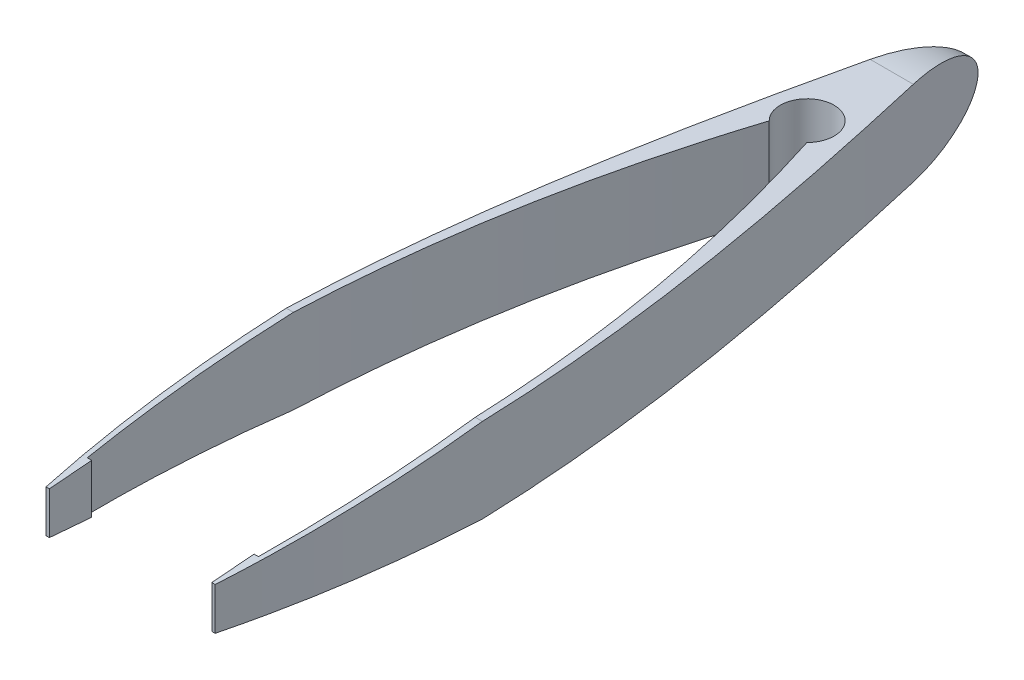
ISO-10303-21;
HEADER;
FILE_DESCRIPTION(('STEP AP214'),'2;1');
FILE_NAME('part.step','',(''),(''),'','','');
FILE_SCHEMA(('AUTOMOTIVE_DESIGN { 1 0 10303 214 1 1 1 1 }'));
ENDSEC;
DATA;
#1=APPLICATION_CONTEXT('core data for automotive mechanical design processes');
#2=APPLICATION_PROTOCOL_DEFINITION('international standard','automotive_design',2000,#1);
#3=PRODUCT_CONTEXT('',#1,'mechanical');
#4=PRODUCT('Part','Part','',(#3));
#5=PRODUCT_RELATED_PRODUCT_CATEGORY('part','',(#4));
#6=PRODUCT_DEFINITION_FORMATION('','',#4);
#7=PRODUCT_DEFINITION_CONTEXT('part definition',#1,'design');
#8=PRODUCT_DEFINITION('design','',#6,#7);
#9=PRODUCT_DEFINITION_SHAPE('','',#8);
#10=(LENGTH_UNIT() NAMED_UNIT(*) SI_UNIT(.MILLI.,.METRE.));
#11=(NAMED_UNIT(*) PLANE_ANGLE_UNIT() SI_UNIT($,.RADIAN.));
#12=(NAMED_UNIT(*) SI_UNIT($,.STERADIAN.) SOLID_ANGLE_UNIT());
#13=UNCERTAINTY_MEASURE_WITH_UNIT(LENGTH_MEASURE(1.E-05),#10,'distance_accuracy_value','');
#14=(GEOMETRIC_REPRESENTATION_CONTEXT(3) GLOBAL_UNCERTAINTY_ASSIGNED_CONTEXT((#13)) GLOBAL_UNIT_ASSIGNED_CONTEXT((#10,
#11,#12)) REPRESENTATION_CONTEXT('',''));
#15=CARTESIAN_POINT('',(0.,0.,0.));
#16=DIRECTION('',(0.,0.,1.));
#17=DIRECTION('',(1.,0.,0.));
#18=AXIS2_PLACEMENT_3D('',#15,#16,#17);
#19=CARTESIAN_POINT('',(-0.2,5.,-100.));
#20=CARTESIAN_POINT('',(-8.02463248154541,5.,-67.3414548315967));
#21=CARTESIAN_POINT('',(-15.036037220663,5.,-33.9340234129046));
#22=CARTESIAN_POINT('',(-10.,5.,0.));
#23=B_SPLINE_CURVE_WITH_KNOTS('',3,(#19,#20,#21,#22),.UNSPECIFIED.,.F.,.F.,(4,4),(0.,1.),.UNSPECIFIED.);
#24=DIRECTION('',(0.,-1.,0.));
#25=VECTOR('',#24,1.);
#26=SURFACE_OF_LINEAR_EXTRUSION('',#23,#25);
#27=CARTESIAN_POINT('',(-2.55320496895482,4.99999999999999,-90.));
#28=CARTESIAN_POINT('',(-2.51110031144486,4.99999542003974,-90.1831487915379));
#29=CARTESIAN_POINT('',(-2.46893483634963,4.99748473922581,-90.3662738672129));
#30=CARTESIAN_POINT('',(-2.38451092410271,4.98741612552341,-90.7323702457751));
#31=CARTESIAN_POINT('',(-2.34225248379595,4.97985801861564,-90.9153415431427));
#32=CARTESIAN_POINT('',(-2.21535430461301,4.94955288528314,-91.4639793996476));
#33=CARTESIAN_POINT('',(-2.130622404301,4.91917499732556,-91.829236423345));
#34=CARTESIAN_POINT('',(-1.96122988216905,4.83732250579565,-92.5574509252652));
#35=CARTESIAN_POINT('',(-1.87656927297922,4.78584473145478,-92.9204080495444));
#36=CARTESIAN_POINT('',(-1.70769191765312,4.66041025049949,-93.6425994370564));
#37=CARTESIAN_POINT('',(-1.62347518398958,4.58645291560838,-94.0018335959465));
#38=CARTESIAN_POINT('',(-1.47207357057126,4.43044575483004,-94.6461699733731));
#39=CARTESIAN_POINT('',(-1.40472174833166,4.35267273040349,-94.9322685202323));
#40=CARTESIAN_POINT('',(-1.27104755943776,4.17941520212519,-95.4991216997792));
#41=CARTESIAN_POINT('',(-1.20472442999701,4.0839445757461,-95.7798803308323));
#42=CARTESIAN_POINT('',(-1.09053801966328,3.9002465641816,-96.2625005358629));
#43=CARTESIAN_POINT('',(-1.04233440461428,3.81652550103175,-96.4659974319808));
#44=CARTESIAN_POINT('',(-0.946963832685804,3.63665573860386,-96.8681826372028));
#45=CARTESIAN_POINT('',(-0.899798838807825,3.54048553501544,-97.0668619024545));
#46=CARTESIAN_POINT('',(-0.816977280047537,3.35639570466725,-97.4153980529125));
#47=CARTESIAN_POINT('',(-0.781022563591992,3.27113240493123,-97.5665846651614));
#48=CARTESIAN_POINT('',(-0.710341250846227,3.09106093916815,-97.8635800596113));
#49=CARTESIAN_POINT('',(-0.675615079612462,2.99624951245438,-98.0093869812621));
#50=CARTESIAN_POINT('',(-0.607870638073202,2.7962288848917,-98.2936426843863));
#51=CARTESIAN_POINT('',(-0.574848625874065,2.69104408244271,-98.4321076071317));
#52=CARTESIAN_POINT('',(-0.510990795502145,2.46891547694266,-98.6997127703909));
#53=CARTESIAN_POINT('',(-0.480153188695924,2.35198148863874,-98.8288606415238));
#54=CARTESIAN_POINT('',(-0.420633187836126,2.101789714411,-99.0780023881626));
#55=CARTESIAN_POINT('',(-0.392027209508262,1.96818783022,-99.1976729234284));
#56=CARTESIAN_POINT('',(-0.33901284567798,1.68578875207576,-99.4193574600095));
#57=CARTESIAN_POINT('',(-0.314606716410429,1.53698345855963,-99.5213619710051));
#58=CARTESIAN_POINT('',(-0.282214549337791,1.30147973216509,-99.6567001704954));
#59=CARTESIAN_POINT('',(-0.27205879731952,1.22025761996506,-99.6991235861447));
#60=CARTESIAN_POINT('',(-0.253490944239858,1.05423359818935,-99.7766757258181));
#61=CARTESIAN_POINT('',(-0.245077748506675,0.969433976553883,-99.8118090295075));
#62=CARTESIAN_POINT('',(-0.230254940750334,0.796964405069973,-99.8737020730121));
#63=CARTESIAN_POINT('',(-0.223838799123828,0.709304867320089,-99.9004891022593));
#64=CARTESIAN_POINT('',(-0.213194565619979,0.53161577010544,-99.9449250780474));
#65=CARTESIAN_POINT('',(-0.208964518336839,0.441588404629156,-99.9625821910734));
#66=CARTESIAN_POINT('',(-0.203948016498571,0.292782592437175,-99.9835214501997));
#67=CARTESIAN_POINT('',(-0.20247010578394,0.234420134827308,-99.9896901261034));
#68=CARTESIAN_POINT('',(-0.200495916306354,0.117373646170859,-99.9979301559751));
#69=CARTESIAN_POINT('',(-0.199999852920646,0.0586895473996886,-100.000000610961));
#70=CARTESIAN_POINT('',(-0.200000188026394,-0.0750287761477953,-99.9999992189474));
#71=CARTESIAN_POINT('',(-0.20081133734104,-0.150066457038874,-99.9966136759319));
#72=CARTESIAN_POINT('',(-0.204034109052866,-0.299533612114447,-99.9831620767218));
#73=CARTESIAN_POINT('',(-0.206446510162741,-0.373962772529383,-99.9730927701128));
#74=CARTESIAN_POINT('',(-0.212812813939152,-0.521734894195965,-99.9465182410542));
#75=CARTESIAN_POINT('',(-0.216769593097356,-0.595075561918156,-99.9300010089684));
#76=CARTESIAN_POINT('',(-0.226125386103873,-0.740045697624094,-99.8909425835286));
#77=CARTESIAN_POINT('',(-0.231524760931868,-0.811674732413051,-99.8683998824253));
#78=CARTESIAN_POINT('',(-0.244940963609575,-0.967919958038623,-99.8123802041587));
#79=CARTESIAN_POINT('',(-0.253270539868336,-1.05204175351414,-99.7775961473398));
#80=CARTESIAN_POINT('',(-0.271641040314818,-1.21673614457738,-99.7008685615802));
#81=CARTESIAN_POINT('',(-0.2816824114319,-1.29730780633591,-99.6589231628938));
#82=CARTESIAN_POINT('',(-0.314047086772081,-1.53349407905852,-99.5237008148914));
#83=CARTESIAN_POINT('',(-0.338604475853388,-1.68350850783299,-99.4210647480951));
#84=CARTESIAN_POINT('',(-0.386160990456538,-1.93702085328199,-99.2222033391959));
#85=CARTESIAN_POINT('',(-0.408329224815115,-2.04352278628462,-99.1294729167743));
#86=CARTESIAN_POINT('',(-0.454730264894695,-2.24787344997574,-98.9352903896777));
#87=CARTESIAN_POINT('',(-0.47896429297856,-2.34571698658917,-98.8338331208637));
#88=CARTESIAN_POINT('',(-0.529070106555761,-2.53345941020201,-98.6239602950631));
#89=CARTESIAN_POINT('',(-0.554944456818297,-2.62334530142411,-98.5155338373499));
#90=CARTESIAN_POINT('',(-0.607964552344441,-2.79572396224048,-98.29323629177));
#91=CARTESIAN_POINT('',(-0.635110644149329,-2.87821469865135,-98.1793637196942));
#92=CARTESIAN_POINT('',(-0.697141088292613,-3.05568413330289,-97.9190111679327));
#93=CARTESIAN_POINT('',(-0.732300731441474,-3.14881550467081,-97.7713406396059));
#94=CARTESIAN_POINT('',(-0.803828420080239,-3.3257564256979,-97.4706957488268));
#95=CARTESIAN_POINT('',(-0.840197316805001,-3.40955922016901,-97.3177176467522));
#96=CARTESIAN_POINT('',(-0.913863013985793,-3.56871239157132,-97.0076061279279));
#97=CARTESIAN_POINT('',(-0.951160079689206,-3.64406031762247,-96.8504715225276));
#98=CARTESIAN_POINT('',(-1.02665253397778,-3.78738723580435,-96.5321421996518));
#99=CARTESIAN_POINT('',(-1.06485140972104,-3.85532860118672,-96.3709314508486));
#100=CARTESIAN_POINT('',(-1.14179944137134,-3.9840365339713,-96.0458884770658));
#101=CARTESIAN_POINT('',(-1.18054837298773,-4.04480593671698,-95.8820573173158));
#102=CARTESIAN_POINT('',(-1.25848718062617,-4.15972805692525,-95.5522108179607));
#103=CARTESIAN_POINT('',(-1.29767704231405,-4.21388098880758,-95.3861955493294));
#104=CARTESIAN_POINT('',(-1.38734616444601,-4.33021356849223,-95.0059535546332));
#105=CARTESIAN_POINT('',(-1.43793512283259,-4.39043947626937,-94.7911543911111));
#106=CARTESIAN_POINT('',(-1.53953108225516,-4.50156981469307,-94.3591834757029));
#107=CARTESIAN_POINT('',(-1.59053823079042,-4.55247079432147,-94.1420108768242));
#108=CARTESIAN_POINT('',(-1.6928533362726,-4.64552757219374,-93.7057470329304));
#109=CARTESIAN_POINT('',(-1.7441614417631,-4.68767859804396,-93.4866548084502));
#110=CARTESIAN_POINT('',(-1.8469667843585,-4.76366452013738,-93.0469852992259));
#111=CARTESIAN_POINT('',(-1.89846409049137,-4.79749599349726,-92.8264074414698));
#112=CARTESIAN_POINT('',(-2.00036350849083,-4.85648116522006,-92.38923513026));
#113=CARTESIAN_POINT('',(-2.05076383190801,-4.88181506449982,-92.1726644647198));
#114=CARTESIAN_POINT('',(-2.15154773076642,-4.92506824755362,-91.738877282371));
#115=CARTESIAN_POINT('',(-2.20193130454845,-4.94299058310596,-91.521661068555));
#116=CARTESIAN_POINT('',(-2.30258341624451,-4.971582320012,-91.0869739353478));
#117=CARTESIAN_POINT('',(-2.3528520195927,-4.98225949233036,-90.8695035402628));
#118=CARTESIAN_POINT('',(-2.45317838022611,-4.99645621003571,-90.4346944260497));
#119=CARTESIAN_POINT('',(-2.50323635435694,-4.99998865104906,-90.217356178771));
#120=CARTESIAN_POINT('',(-2.55320496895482,-5.00000000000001,-90.));
#121=B_SPLINE_CURVE_WITH_KNOTS('',3,(#27,#28,#29,#30,#31,#32,#33,#34,#35,#36,#37,#38,#39,#40,
#41,#42,#43,#44,#45,#46,#47,#48,#49,#50,#51,#52,#53,#54,#55,#56,#57,#58,#59,#60,#61,#62,#63,#64,
#65,#66,#67,#68,#69,#70,#71,#72,#73,#74,#75,#76,#77,#78,#79,#80,#81,#82,#83,#84,#85,#86,#87,#88,
#89,#90,#91,#92,#93,#94,#95,#96,#97,#98,#99,#100,#101,#102,#103,#104,#105,#106,#107,#108,#109,
#110,#111,#112,#113,#114,#115,#116,#117,#118,#119,#120),.UNSPECIFIED.,.F.,.F.,(4,2,2,2,2,2,2,2,
2,2,2,2,2,2,2,2,2,2,2,2,2,2,2,2,2,2,2,2,2,2,2,2,2,2,2,2,2,2,2,2,2,2,2,2,2,2,4),(0.,
0.56374265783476,1.12750475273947,2.25543935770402,3.38354352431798,4.51167922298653,
5.42331552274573,6.33423996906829,7.00970909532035,7.68636097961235,8.21784519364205,
8.74951152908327,9.2799559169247,9.80996082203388,10.3536800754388,10.8976905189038,
11.1739672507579,11.4500698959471,11.7252600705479,12.0002036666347,12.1761835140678,
12.3522019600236,12.5772241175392,12.8023557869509,13.0279087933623,13.2535182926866,
13.527322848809,13.801199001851,14.3491784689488,14.7774873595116,15.2060514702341,
15.6353030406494,16.0646722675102,16.5985476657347,17.1328071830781,17.6672211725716,
18.2042346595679,18.7410351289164,19.2778181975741,19.9638272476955,20.6500896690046,
21.3367254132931,22.0236431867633,22.694905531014,23.3658912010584,24.0361560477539,
24.705210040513),.UNSPECIFIED.);
#122=CARTESIAN_POINT('',(-2.55320496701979,5.,-90.0000000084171));
#123=VERTEX_POINT('',#122);
#124=CARTESIAN_POINT('',(-2.55320496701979,-4.99999999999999,-90.));
#125=VERTEX_POINT('',#124);
#126=EDGE_CURVE('E51',#123,#125,#121,.T.);
#127=ORIENTED_EDGE('',*,*,#126,.T.);
#128=CARTESIAN_POINT('',(-0.2,-5.,-100.));
#129=CARTESIAN_POINT('',(-8.02463248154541,-5.,-67.3414548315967));
#130=CARTESIAN_POINT('',(-15.036037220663,-5.,-33.9340234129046));
#131=CARTESIAN_POINT('',(-10.,-5.,0.));
#132=B_SPLINE_CURVE_WITH_KNOTS('',3,(#128,#129,#130,#131),.UNSPECIFIED.,.F.,.F.,(4,4),(0.,1.),.UNSPECIFIED.);
#133=CARTESIAN_POINT('',(-11.5963504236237,-5.,-30.));
#134=VERTEX_POINT('',#133);
#135=EDGE_CURVE('E150',#125,#134,#132,.T.);
#136=ORIENTED_EDGE('',*,*,#135,.T.);
#137=CARTESIAN_POINT('',(-10.,-2.5,0.));
#138=CARTESIAN_POINT('',(-10.122951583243,-2.56903757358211,-0.828450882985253));
#139=CARTESIAN_POINT('',(-10.2389138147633,-2.6381606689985,-1.65792802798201));
#140=CARTESIAN_POINT('',(-10.4569081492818,-2.77647333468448,-3.3176800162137));
#141=CARTESIAN_POINT('',(-10.5589569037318,-2.845662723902,-4.14795268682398));
#142=CARTESIAN_POINT('',(-10.7493801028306,-2.9841056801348,-5.8092681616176));
#143=CARTESIAN_POINT('',(-10.8377672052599,-3.05335912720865,-6.64030952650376));
#144=CARTESIAN_POINT('',(-11.0011329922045,-3.19192804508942,-8.30313654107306));
#145=CARTESIAN_POINT('',(-11.0761206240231,-3.26124344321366,-9.13492131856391));
#146=CARTESIAN_POINT('',(-11.2129556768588,-3.39993404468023,-10.7992085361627));
#147=CARTESIAN_POINT('',(-11.2748086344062,-3.46930921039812,-11.6317105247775));
#148=CARTESIAN_POINT('',(-11.3856469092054,-3.60811711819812,-13.2974054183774));
#149=CARTESIAN_POINT('',(-11.4346346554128,-3.67754984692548,-14.1305981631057));
#150=CARTESIAN_POINT('',(-11.5200114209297,-3.81645851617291,-15.7975021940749));
#151=CARTESIAN_POINT('',(-11.5564022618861,-3.88593444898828,-16.6312133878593));
#152=CARTESIAN_POINT('',(-11.6168780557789,-4.02494134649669,-18.2992961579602));
#153=CARTESIAN_POINT('',(-11.6409597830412,-4.09447232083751,-19.1336678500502));
#154=CARTESIAN_POINT('',(-11.6771008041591,-4.233589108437,-20.803069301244));
#155=CARTESIAN_POINT('',(-11.6891543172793,-4.30317493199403,-21.6380991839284));
#156=CARTESIAN_POINT('',(-11.7015249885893,-4.44240125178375,-23.308815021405));
#157=CARTESIAN_POINT('',(-11.7018341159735,-4.51204175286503,-24.1445010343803));
#158=CARTESIAN_POINT('',(-11.6910040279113,-4.65137718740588,-25.8165262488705));
#159=CARTESIAN_POINT('',(-11.6798548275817,-4.72107211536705,-26.6528653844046));
#160=CARTESIAN_POINT('',(-11.6464008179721,-4.86051645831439,-28.3261974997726));
#161=CARTESIAN_POINT('',(-11.6240843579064,-4.93026585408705,-29.1631902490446));
#162=CARTESIAN_POINT('',(-11.5963504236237,-5.,-30.));
#163=B_SPLINE_CURVE_WITH_KNOTS('',3,(#137,#138,#139,#140,#141,#142,#143,#144,#145,#146,#147,
#148,#149,#150,#151,#152,#153,#154,#155,#156,#157,#158,#159,#160,#161,#162),.UNSPECIFIED.,.F.,
.F.,(4,2,2,2,2,2,2,2,2,2,2,2,4),(0.,2.52106110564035,5.0390780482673,7.55474783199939,
10.0687314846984,12.5816533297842,15.0941003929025,17.6061839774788,20.1189255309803,
22.6328741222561,25.148541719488,27.6664033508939,30.1868973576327),.UNSPECIFIED.);
#164=CARTESIAN_POINT('',(-10.,-2.5,0.));
#165=VERTEX_POINT('',#164);
#166=EDGE_CURVE('E255',#165,#134,#163,.T.);
#167=ORIENTED_EDGE('',*,*,#166,.F.);
#168=DIRECTION('',(0.,-1.,0.));
#169=VECTOR('',#168,1.);
#170=CARTESIAN_POINT('',(-10.,5.,0.));
#171=LINE('',#170,#169);
#172=CARTESIAN_POINT('',(-10.,2.5,0.));
#173=VERTEX_POINT('',#172);
#174=EDGE_CURVE('E225',#173,#165,#171,.T.);
#175=ORIENTED_EDGE('',*,*,#174,.F.);
#176=CARTESIAN_POINT('',(-10.,2.5,0.));
#177=CARTESIAN_POINT('',(-10.122951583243,2.56903757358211,-0.828450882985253));
#178=CARTESIAN_POINT('',(-10.2389138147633,2.6381606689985,-1.65792802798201));
#179=CARTESIAN_POINT('',(-10.4569081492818,2.77647333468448,-3.3176800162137));
#180=CARTESIAN_POINT('',(-10.5589569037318,2.845662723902,-4.14795268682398));
#181=CARTESIAN_POINT('',(-10.7493801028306,2.9841056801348,-5.8092681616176));
#182=CARTESIAN_POINT('',(-10.8377672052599,3.05335912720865,-6.64030952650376));
#183=CARTESIAN_POINT('',(-11.0011329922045,3.19192804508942,-8.30313654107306));
#184=CARTESIAN_POINT('',(-11.0761206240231,3.26124344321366,-9.13492131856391));
#185=CARTESIAN_POINT('',(-11.2129556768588,3.39993404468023,-10.7992085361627));
#186=CARTESIAN_POINT('',(-11.2748086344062,3.46930921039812,-11.6317105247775));
#187=CARTESIAN_POINT('',(-11.3856469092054,3.60811711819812,-13.2974054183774));
#188=CARTESIAN_POINT('',(-11.4346346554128,3.67754984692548,-14.1305981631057));
#189=CARTESIAN_POINT('',(-11.5200114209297,3.81645851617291,-15.7975021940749));
#190=CARTESIAN_POINT('',(-11.5564022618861,3.88593444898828,-16.6312133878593));
#191=CARTESIAN_POINT('',(-11.6168780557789,4.02494134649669,-18.2992961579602));
#192=CARTESIAN_POINT('',(-11.6409597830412,4.09447232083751,-19.1336678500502));
#193=CARTESIAN_POINT('',(-11.6771008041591,4.233589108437,-20.803069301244));
#194=CARTESIAN_POINT('',(-11.6891543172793,4.30317493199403,-21.6380991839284));
#195=CARTESIAN_POINT('',(-11.7015249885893,4.44240125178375,-23.308815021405));
#196=CARTESIAN_POINT('',(-11.7018341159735,4.51204175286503,-24.1445010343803));
#197=CARTESIAN_POINT('',(-11.6910040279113,4.65137718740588,-25.8165262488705));
#198=CARTESIAN_POINT('',(-11.6798548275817,4.72107211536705,-26.6528653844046));
#199=CARTESIAN_POINT('',(-11.6464008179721,4.86051645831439,-28.3261974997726));
#200=CARTESIAN_POINT('',(-11.6240843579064,4.93026585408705,-29.1631902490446));
#201=CARTESIAN_POINT('',(-11.5963504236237,5.,-30.));
#202=B_SPLINE_CURVE_WITH_KNOTS('',3,(#176,#177,#178,#179,#180,#181,#182,#183,#184,#185,#186,
#187,#188,#189,#190,#191,#192,#193,#194,#195,#196,#197,#198,#199,#200,#201),.UNSPECIFIED.,.F.,
.F.,(4,2,2,2,2,2,2,2,2,2,2,2,4),(0.,2.52106110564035,5.0390780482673,7.55474783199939,
10.0687314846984,12.5816533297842,15.0941003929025,17.6061839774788,20.1189255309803,
22.6328741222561,25.148541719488,27.6664033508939,30.1868973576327),.UNSPECIFIED.);
#203=CARTESIAN_POINT('',(-11.5963504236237,5.,-30.));
#204=VERTEX_POINT('',#203);
#205=EDGE_CURVE('E352',#173,#204,#202,.T.);
#206=ORIENTED_EDGE('',*,*,#205,.T.);
#207=EDGE_CURVE('E153',#123,#204,#23,.T.);
#208=ORIENTED_EDGE('',*,*,#207,.F.);
#209=EDGE_LOOP('',(#127,#136,#167,#175,#206,#208));
#210=FACE_BOUND('',#209,.T.);
#211=ADVANCED_FACE('F36',(#210),#26,.F.);
#212=CARTESIAN_POINT('',(10.,5.,0.));
#213=CARTESIAN_POINT('',(15.036037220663,5.,-33.9340234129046));
#214=CARTESIAN_POINT('',(8.02463248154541,5.,-67.3414548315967));
#215=CARTESIAN_POINT('',(0.2,5.,-100.));
#216=B_SPLINE_CURVE_WITH_KNOTS('',3,(#212,#213,#214,#215),.UNSPECIFIED.,.F.,.F.,(4,4),(0.,1.),.UNSPECIFIED.);
#217=DIRECTION('',(0.,-1.,0.));
#218=VECTOR('',#217,1.);
#219=SURFACE_OF_LINEAR_EXTRUSION('',#216,#218);
#220=CARTESIAN_POINT('',(10.,-5.,0.));
#221=CARTESIAN_POINT('',(15.036037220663,-5.,-33.9340234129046));
#222=CARTESIAN_POINT('',(8.02463248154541,-5.,-67.3414548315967));
#223=CARTESIAN_POINT('',(0.2,-5.,-100.));
#224=B_SPLINE_CURVE_WITH_KNOTS('',3,(#220,#221,#222,#223),.UNSPECIFIED.,.F.,.F.,(4,4),(0.,1.),.UNSPECIFIED.);
#225=CARTESIAN_POINT('',(11.5963504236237,-5.,-30.));
#226=VERTEX_POINT('',#225);
#227=CARTESIAN_POINT('',(2.5532049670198,-4.99999999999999,-90.));
#228=VERTEX_POINT('',#227);
#229=EDGE_CURVE('E200',#226,#228,#224,.T.);
#230=ORIENTED_EDGE('',*,*,#229,.T.);
#231=CARTESIAN_POINT('',(2.55320496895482,-4.99999999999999,-90.));
#232=CARTESIAN_POINT('',(2.4924488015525,-4.99997489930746,-90.2642809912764));
#233=CARTESIAN_POINT('',(2.43155962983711,-4.99476039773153,-90.5285386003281));
#234=CARTESIAN_POINT('',(2.30933327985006,-4.97373206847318,-91.0578523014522));
#235=CARTESIAN_POINT('',(2.24799534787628,-4.95786796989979,-91.3229062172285));
#236=CARTESIAN_POINT('',(2.12509582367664,-4.91525655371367,-91.8528848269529));
#237=CARTESIAN_POINT('',(2.06353408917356,-4.88847861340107,-92.1178070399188));
#238=CARTESIAN_POINT('',(1.94041810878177,-4.82363483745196,-92.6465826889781));
#239=CARTESIAN_POINT('',(1.87886394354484,-4.78555678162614,-92.9104346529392));
#240=CARTESIAN_POINT('',(1.75538881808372,-4.69716517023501,-93.4387341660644));
#241=CARTESIAN_POINT('',(1.69346996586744,-4.64673828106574,-93.7031633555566));
#242=CARTESIAN_POINT('',(1.57010644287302,-4.53312505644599,-94.2290769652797));
#243=CARTESIAN_POINT('',(1.50866132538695,-4.4699528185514,-94.4905643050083));
#244=CARTESIAN_POINT('',(1.3865015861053,-4.32986470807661,-95.0095854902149));
#245=CARTESIAN_POINT('',(1.32578601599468,-4.25296935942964,-95.267124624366));
#246=CARTESIAN_POINT('',(1.20535569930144,-4.08404314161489,-95.7771902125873));
#247=CARTESIAN_POINT('',(1.14563998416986,-3.99202798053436,-96.0297215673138));
#248=CARTESIAN_POINT('',(1.05481187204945,-3.83729581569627,-96.413295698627));
#249=CARTESIAN_POINT('',(1.02320424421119,-3.78062763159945,-96.5466762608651));
#250=CARTESIAN_POINT('',(0.960481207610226,-3.66195033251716,-96.8111728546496));
#251=CARTESIAN_POINT('',(0.929365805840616,-3.59994114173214,-96.9422888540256));
#252=CARTESIAN_POINT('',(0.867731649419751,-3.47013365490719,-97.2018325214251));
#253=CARTESIAN_POINT('',(0.837213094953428,-3.40233345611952,-97.3302592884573));
#254=CARTESIAN_POINT('',(0.776927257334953,-3.260456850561,-97.583791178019));
#255=CARTESIAN_POINT('',(0.747159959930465,-3.18638056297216,-97.7088963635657));
#256=CARTESIAN_POINT('',(0.688307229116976,-3.03069368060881,-97.9560950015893));
#257=CARTESIAN_POINT('',(0.659229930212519,-2.9490234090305,-98.0781530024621));
#258=CARTESIAN_POINT('',(0.602269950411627,-2.77799452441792,-98.3171226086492));
#259=CARTESIAN_POINT('',(0.574387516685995,-2.68863433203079,-98.4340331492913));
#260=CARTESIAN_POINT('',(0.520213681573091,-2.50168095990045,-98.6610687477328));
#261=CARTESIAN_POINT('',(0.49391887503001,-2.40410655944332,-98.7712083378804));
#262=CARTESIAN_POINT('',(0.443311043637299,-2.19982779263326,-98.9830912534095));
#263=CARTESIAN_POINT('',(0.418996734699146,-2.09312943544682,-99.0848400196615));
#264=CARTESIAN_POINT('',(0.369477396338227,-1.85318767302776,-99.2919839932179));
#265=CARTESIAN_POINT('',(0.344679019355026,-1.71835750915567,-99.3956654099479));
#266=CARTESIAN_POINT('',(0.29961175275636,-1.43487083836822,-99.5840238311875));
#267=CARTESIAN_POINT('',(0.279344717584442,-1.28620870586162,-99.6686930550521));
#268=CARTESIAN_POINT('',(0.25337524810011,-1.05276729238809,-99.777158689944));
#269=CARTESIAN_POINT('',(0.245414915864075,-0.972573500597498,-99.8104009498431));
#270=CARTESIAN_POINT('',(0.231260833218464,-0.809378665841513,-99.8695021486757));
#271=CARTESIAN_POINT('',(0.2250659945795,-0.726379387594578,-99.895365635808));
#272=CARTESIAN_POINT('',(0.214644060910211,-0.558428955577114,-99.9388742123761));
#273=CARTESIAN_POINT('',(0.21041036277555,-0.47348537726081,-99.9565468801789));
#274=CARTESIAN_POINT('',(0.204027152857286,-0.302214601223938,-99.9831912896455));
#275=CARTESIAN_POINT('',(0.201875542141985,-0.215888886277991,-99.9921717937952));
#276=CARTESIAN_POINT('',(0.200534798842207,-0.107824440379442,-99.9977678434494));
#277=CARTESIAN_POINT('',(0.200334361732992,-0.0862701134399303,-99.9986044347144));
#278=CARTESIAN_POINT('',(0.200066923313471,-0.0431447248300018,-99.9997206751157));
#279=CARTESIAN_POINT('',(0.199999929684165,-0.021573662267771,-100.000000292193));
#280=CARTESIAN_POINT('',(0.200000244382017,0.0749790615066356,-99.9999989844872));
#281=CARTESIAN_POINT('',(0.200810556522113,0.149989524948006,-99.9966169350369));
#282=CARTESIAN_POINT('',(0.204030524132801,0.299408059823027,-99.9831770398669));
#283=CARTESIAN_POINT('',(0.206441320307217,0.373815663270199,-99.9731144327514));
#284=CARTESIAN_POINT('',(0.21280566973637,0.521595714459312,-99.9465480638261));
#285=CARTESIAN_POINT('',(0.216763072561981,0.594965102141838,-99.9300282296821));
#286=CARTESIAN_POINT('',(0.226121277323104,0.739991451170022,-99.890959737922));
#287=CARTESIAN_POINT('',(0.231522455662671,0.811647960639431,-99.8684095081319));
#288=CARTESIAN_POINT('',(0.24494104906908,0.967920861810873,-99.8123798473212));
#289=CARTESIAN_POINT('',(0.253270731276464,1.05204366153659,-99.7775953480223));
#290=CARTESIAN_POINT('',(0.271641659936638,1.21674150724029,-99.7008659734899));
#291=CARTESIAN_POINT('',(0.281683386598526,1.2973155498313,-99.6589190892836));
#292=CARTESIAN_POINT('',(0.314048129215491,1.53350043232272,-99.5236964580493));
#293=CARTESIAN_POINT('',(0.338605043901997,1.68351153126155,-99.4210623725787));
#294=CARTESIAN_POINT('',(0.386163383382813,1.9370336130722,-99.2221933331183));
#295=CARTESIAN_POINT('',(0.408334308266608,2.04354721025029,-99.1294516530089));
#296=CARTESIAN_POINT('',(0.454741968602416,2.24792295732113,-98.9352414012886));
#297=CARTESIAN_POINT('',(0.478979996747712,2.34577961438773,-98.833767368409));
#298=CARTESIAN_POINT('',(0.529093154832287,2.53354197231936,-98.6238637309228));
#299=CARTESIAN_POINT('',(0.554970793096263,2.62343496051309,-98.5154234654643));
#300=CARTESIAN_POINT('',(0.607985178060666,2.79578698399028,-98.2931497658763));
#301=CARTESIAN_POINT('',(0.635121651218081,2.87824762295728,-98.1793175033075));
#302=CARTESIAN_POINT('',(0.688336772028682,3.03049361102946,-97.9559644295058));
#303=CARTESIAN_POINT('',(0.71434315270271,3.10076565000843,-97.8467561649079));
#304=CARTESIAN_POINT('',(0.767064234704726,3.23597725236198,-97.6252429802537));
#305=CARTESIAN_POINT('',(0.793779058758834,3.30091588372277,-97.5129375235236));
#306=CARTESIAN_POINT('',(0.874709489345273,3.48815488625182,-97.1725185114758));
#307=CARTESIAN_POINT('',(0.92979477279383,3.60311260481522,-96.9405510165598));
#308=CARTESIAN_POINT('',(1.04141319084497,3.81577351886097,-96.4699119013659));
#309=CARTESIAN_POINT('',(1.09794308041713,3.91351205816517,-96.2312552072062));
#310=CARTESIAN_POINT('',(1.2121143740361,4.0940412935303,-95.7485760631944));
#311=CARTESIAN_POINT('',(1.26975605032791,4.17682827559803,-95.5045522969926));
#312=CARTESIAN_POINT('',(1.38573379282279,4.32882775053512,-95.012826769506));
#313=CARTESIAN_POINT('',(1.44406899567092,4.39805555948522,-94.7651295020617));
#314=CARTESIAN_POINT('',(1.5612591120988,4.5241854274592,-94.2667287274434));
#315=CARTESIAN_POINT('',(1.62011408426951,4.58108607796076,-94.0160248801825));
#316=CARTESIAN_POINT('',(1.75129682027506,4.69480303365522,-93.4562709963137));
#317=CARTESIAN_POINT('',(1.82370574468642,4.74877795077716,-93.1466622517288));
#318=CARTESIAN_POINT('',(1.96874695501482,4.8406845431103,-92.5250955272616));
#319=CARTESIAN_POINT('',(2.04137927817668,4.87861337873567,-92.2131371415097));
#320=CARTESIAN_POINT('',(2.18735954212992,4.93944250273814,-91.5846417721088));
#321=CARTESIAN_POINT('',(2.26070746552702,4.96219065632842,-91.2680899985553));
#322=CARTESIAN_POINT('',(2.37055832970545,4.98489711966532,-90.7927791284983));
#323=CARTESIAN_POINT('',(2.40714025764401,4.99056331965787,-90.6342900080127));
#324=CARTESIAN_POINT('',(2.4802317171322,4.99811345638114,-90.3172062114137));
#325=CARTESIAN_POINT('',(2.51674124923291,4.99999742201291,-90.158611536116));
#326=CARTESIAN_POINT('',(2.55320496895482,4.99999999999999,-90.));
#327=B_SPLINE_CURVE_WITH_KNOTS('',3,(#231,#232,#233,#234,#235,#236,#237,#238,#239,#240,#241,
#242,#243,#244,#245,#246,#247,#248,#249,#250,#251,#252,#253,#254,#255,#256,#257,#258,#259,#260,
#261,#262,#263,#264,#265,#266,#267,#268,#269,#270,#271,#272,#273,#274,#275,#276,#277,#278,#279,
#280,#281,#282,#283,#284,#285,#286,#287,#288,#289,#290,#291,#292,#293,#294,#295,#296,#297,#298,
#299,#300,#301,#302,#303,#304,#305,#306,#307,#308,#309,#310,#311,#312,#313,#314,#315,#316,#317,
#318,#319,#320,#321,#322,#323,#324,#325,#326),.UNSPECIFIED.,.F.,.F.,(4,2,2,2,2,2,2,2,2,2,2,2,2,
2,2,2,2,2,2,2,2,2,2,2,2,2,2,2,2,2,2,2,2,2,2,2,2,2,2,2,2,2,2,2,2,2,2,4),(0.,0.813485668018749,
1.63083861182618,2.45050089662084,3.27105283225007,4.09943800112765,4.92691187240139,
5.75315841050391,6.57855191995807,7.02343729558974,7.4683289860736,7.91336742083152,
8.35839740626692,8.80728029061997,9.25625558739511,9.70423095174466,10.1519135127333,
10.6662703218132,11.180837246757,11.442049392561,11.7031001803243,11.963265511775,
12.2231682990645,12.2878783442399,12.3525921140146,12.5775042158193,12.8025767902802,
13.0282131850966,13.2539084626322,13.5277161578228,13.801600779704,14.3495686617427,
14.7779267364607,15.2065546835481,15.635854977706,16.0650624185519,16.4622277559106,
16.8594623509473,17.6526446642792,18.444179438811,19.2359105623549,20.0267421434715,
20.8176640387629,21.7847429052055,22.7519928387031,23.7287961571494,24.2170233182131,
24.7052467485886),.UNSPECIFIED.);
#328=CARTESIAN_POINT('',(2.5532049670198,4.99999999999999,-90.));
#329=VERTEX_POINT('',#328);
#330=EDGE_CURVE('E155',#228,#329,#327,.T.);
#331=ORIENTED_EDGE('',*,*,#330,.T.);
#332=CARTESIAN_POINT('',(11.5963504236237,5.,-30.));
#333=VERTEX_POINT('',#332);
#334=EDGE_CURVE('E180',#333,#329,#216,.T.);
#335=ORIENTED_EDGE('',*,*,#334,.F.);
#336=CARTESIAN_POINT('',(11.5963504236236,5.00000000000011,-30.0000000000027));
#337=CARTESIAN_POINT('',(11.6240843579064,4.93026585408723,-29.1631902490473));
#338=CARTESIAN_POINT('',(11.646400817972,4.86051645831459,-28.3261974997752));
#339=CARTESIAN_POINT('',(11.6798548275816,4.72107211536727,-26.652865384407));
#340=CARTESIAN_POINT('',(11.6910040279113,4.65137718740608,-25.8165262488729));
#341=CARTESIAN_POINT('',(11.7018341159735,4.5120417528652,-24.1445010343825));
#342=CARTESIAN_POINT('',(11.7015249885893,4.44240125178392,-23.3088150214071));
#343=CARTESIAN_POINT('',(11.6891543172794,4.30317493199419,-21.6380991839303));
#344=CARTESIAN_POINT('',(11.6771008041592,4.23358910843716,-20.8030693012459));
#345=CARTESIAN_POINT('',(11.6409597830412,4.09447232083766,-19.1336678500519));
#346=CARTESIAN_POINT('',(11.616878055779,4.02494134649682,-18.2992961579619));
#347=CARTESIAN_POINT('',(11.5564022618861,3.8859344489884,-16.6312133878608));
#348=CARTESIAN_POINT('',(11.5200114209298,3.81645851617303,-15.7975021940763));
#349=CARTESIAN_POINT('',(11.4346346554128,3.67754984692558,-14.130598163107));
#350=CARTESIAN_POINT('',(11.3856469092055,3.60811711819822,-13.2974054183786));
#351=CARTESIAN_POINT('',(11.2748086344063,3.46930921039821,-11.6317105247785));
#352=CARTESIAN_POINT('',(11.2129556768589,3.39993404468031,-10.7992085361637));
#353=CARTESIAN_POINT('',(11.0761206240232,3.26124344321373,-9.13492131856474));
#354=CARTESIAN_POINT('',(11.0011329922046,3.19192804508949,-8.30313654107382));
#355=CARTESIAN_POINT('',(10.83776720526,3.0533591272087,-6.64030952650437));
#356=CARTESIAN_POINT('',(10.7493801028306,2.98410568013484,-5.80926816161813));
#357=CARTESIAN_POINT('',(10.5589569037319,2.84566272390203,-4.14795268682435));
#358=CARTESIAN_POINT('',(10.4569081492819,2.7764733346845,-3.317680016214));
#359=CARTESIAN_POINT('',(10.2389138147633,2.63816066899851,-1.65792802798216));
#360=CARTESIAN_POINT('',(10.122951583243,2.56903757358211,-0.828450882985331));
#361=CARTESIAN_POINT('',(10.,2.5,0.));
#362=B_SPLINE_CURVE_WITH_KNOTS('',3,(#336,#337,#338,#339,#340,#341,#342,#343,#344,#345,#346,
#347,#348,#349,#350,#351,#352,#353,#354,#355,#356,#357,#358,#359,#360,#361),.UNSPECIFIED.,.F.,
.F.,(4,2,2,2,2,2,2,2,2,2,2,2,4),(0.,2.520494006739,5.03835563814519,7.55402323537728,
10.0679718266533,12.580713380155,15.0927969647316,17.6052440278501,20.1181658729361,
22.6321495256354,25.1478193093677,27.6658362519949,30.1868973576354),.UNSPECIFIED.);
#363=CARTESIAN_POINT('',(10.,2.5,0.));
#364=VERTEX_POINT('',#363);
#365=EDGE_CURVE('E348',#333,#364,#362,.T.);
#366=ORIENTED_EDGE('',*,*,#365,.T.);
#367=DIRECTION('',(0.,-1.,0.));
#368=VECTOR('',#367,1.);
#369=CARTESIAN_POINT('',(10.,5.,0.));
#370=LINE('',#369,#368);
#371=CARTESIAN_POINT('',(10.,-2.5,0.));
#372=VERTEX_POINT('',#371);
#373=EDGE_CURVE('E207',#364,#372,#370,.T.);
#374=ORIENTED_EDGE('',*,*,#373,.T.);
#375=CARTESIAN_POINT('',(11.5963504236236,-5.00000000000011,-30.0000000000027));
#376=CARTESIAN_POINT('',(11.6240843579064,-4.93026585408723,-29.1631902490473));
#377=CARTESIAN_POINT('',(11.646400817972,-4.86051645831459,-28.3261974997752));
#378=CARTESIAN_POINT('',(11.6798548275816,-4.72107211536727,-26.652865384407));
#379=CARTESIAN_POINT('',(11.6910040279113,-4.65137718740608,-25.8165262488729));
#380=CARTESIAN_POINT('',(11.7018341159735,-4.5120417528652,-24.1445010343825));
#381=CARTESIAN_POINT('',(11.7015249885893,-4.44240125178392,-23.3088150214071));
#382=CARTESIAN_POINT('',(11.6891543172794,-4.30317493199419,-21.6380991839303));
#383=CARTESIAN_POINT('',(11.6771008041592,-4.23358910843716,-20.8030693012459));
#384=CARTESIAN_POINT('',(11.6409597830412,-4.09447232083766,-19.1336678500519));
#385=CARTESIAN_POINT('',(11.616878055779,-4.02494134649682,-18.2992961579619));
#386=CARTESIAN_POINT('',(11.5564022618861,-3.8859344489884,-16.6312133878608));
#387=CARTESIAN_POINT('',(11.5200114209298,-3.81645851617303,-15.7975021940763));
#388=CARTESIAN_POINT('',(11.4346346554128,-3.67754984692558,-14.130598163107));
#389=CARTESIAN_POINT('',(11.3856469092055,-3.60811711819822,-13.2974054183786));
#390=CARTESIAN_POINT('',(11.2748086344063,-3.46930921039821,-11.6317105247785));
#391=CARTESIAN_POINT('',(11.2129556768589,-3.39993404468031,-10.7992085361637));
#392=CARTESIAN_POINT('',(11.0761206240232,-3.26124344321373,-9.13492131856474));
#393=CARTESIAN_POINT('',(11.0011329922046,-3.19192804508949,-8.30313654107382));
#394=CARTESIAN_POINT('',(10.83776720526,-3.0533591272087,-6.64030952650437));
#395=CARTESIAN_POINT('',(10.7493801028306,-2.98410568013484,-5.80926816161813));
#396=CARTESIAN_POINT('',(10.5589569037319,-2.84566272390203,-4.14795268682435));
#397=CARTESIAN_POINT('',(10.4569081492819,-2.7764733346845,-3.317680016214));
#398=CARTESIAN_POINT('',(10.2389138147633,-2.63816066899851,-1.65792802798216));
#399=CARTESIAN_POINT('',(10.122951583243,-2.56903757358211,-0.828450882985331));
#400=CARTESIAN_POINT('',(10.,-2.5,0.));
#401=B_SPLINE_CURVE_WITH_KNOTS('',3,(#375,#376,#377,#378,#379,#380,#381,#382,#383,#384,#385,
#386,#387,#388,#389,#390,#391,#392,#393,#394,#395,#396,#397,#398,#399,#400),.UNSPECIFIED.,.F.,
.F.,(4,2,2,2,2,2,2,2,2,2,2,2,4),(0.,2.520494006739,5.03835563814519,7.55402323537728,
10.0679718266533,12.580713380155,15.0927969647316,17.6052440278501,20.1181658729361,
22.6321495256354,25.1478193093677,27.6658362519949,30.1868973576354),.UNSPECIFIED.);
#402=EDGE_CURVE('E302',#226,#372,#401,.T.);
#403=ORIENTED_EDGE('',*,*,#402,.F.);
#404=EDGE_LOOP('',(#230,#331,#335,#366,#374,#403));
#405=FACE_BOUND('',#404,.T.);
#406=ADVANCED_FACE('F346',(#405),#219,.F.);
#407=CARTESIAN_POINT('',(-9.92275113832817,-5.,-50.478304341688));
#408=DIRECTION('',(0.,-1.,0.));
#409=DIRECTION('',(0.,0.,-1.));
#410=AXIS2_PLACEMENT_3D('',#407,#408,#409);
#411=PLANE('',#410);
#412=ORIENTED_EDGE('',*,*,#135,.F.);
#413=DIRECTION('',(1.,0.,0.));
#414=VECTOR('',#413,1.);
#415=CARTESIAN_POINT('',(-13.5437996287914,-4.99999999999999,-90.));
#416=LINE('',#415,#414);
#417=EDGE_CURVE('E158',#125,#228,#416,.T.);
#418=ORIENTED_EDGE('',*,*,#417,.T.);
#419=ORIENTED_EDGE('',*,*,#229,.F.);
#420=DIRECTION('',(1.,0.,0.));
#421=VECTOR('',#420,1.);
#422=CARTESIAN_POINT('',(-13.5437996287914,-5.,-30.));
#423=LINE('',#422,#421);
#424=CARTESIAN_POINT('',(10.7519372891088,-5.,-30.));
#425=VERTEX_POINT('',#424);
#426=EDGE_CURVE('E335',#425,#226,#423,.T.);
#427=ORIENTED_EDGE('',*,*,#426,.F.);
#428=CARTESIAN_POINT('',(2.22636123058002,-5.,-77.7363876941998));
#429=CARTESIAN_POINT('',(14.3013267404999,-5.,-39.9156580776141));
#430=CARTESIAN_POINT('',(9.6,-5.,0.));
#431=B_SPLINE_CURVE_WITH_KNOTS('',2,(#428,#429,#430),.UNSPECIFIED.,.F.,.F.,(3,3),(0.,1.),.UNSPECIFIED.);
#432=CARTESIAN_POINT('',(2.22636123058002,-5.,-77.7363876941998));
#433=VERTEX_POINT('',#432);
#434=EDGE_CURVE('E195',#433,#425,#431,.T.);
#435=ORIENTED_EDGE('',*,*,#434,.F.);
#436=CARTESIAN_POINT('',(0.,-5.,-80.));
#437=DIRECTION('',(0.,-1.,0.));
#438=DIRECTION('',(0.,0.,1.));
#439=AXIS2_PLACEMENT_3D('',#436,#437,#438);
#440=CIRCLE('',#439,3.175);
#441=CARTESIAN_POINT('',(-2.22636123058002,-5.,-77.7363876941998));
#442=VERTEX_POINT('',#441);
#443=EDGE_CURVE('E172',#442,#433,#440,.T.);
#444=ORIENTED_EDGE('',*,*,#443,.F.);
#445=CARTESIAN_POINT('',(-9.6,-5.,0.));
#446=CARTESIAN_POINT('',(-14.3013267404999,-5.,-39.9156580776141));
#447=CARTESIAN_POINT('',(-2.22636123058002,-5.,-77.7363876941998));
#448=B_SPLINE_CURVE_WITH_KNOTS('',2,(#445,#446,#447),.UNSPECIFIED.,.F.,.F.,(3,3),(0.,1.),.UNSPECIFIED.);
#449=CARTESIAN_POINT('',(-10.7519372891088,-5.,-30.));
#450=VERTEX_POINT('',#449);
#451=EDGE_CURVE('E169',#450,#442,#448,.T.);
#452=ORIENTED_EDGE('',*,*,#451,.F.);
#453=EDGE_CURVE('E168',#134,#450,#423,.T.);
#454=ORIENTED_EDGE('',*,*,#453,.F.);
#455=EDGE_LOOP('',(#412,#418,#419,#427,#435,#444,#452,#454));
#456=FACE_BOUND('',#455,.T.);
#457=ADVANCED_FACE('F166',(#456),#411,.T.);
#458=CARTESIAN_POINT('',(-9.92275113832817,5.,-50.478304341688));
#459=DIRECTION('',(0.,-1.,0.));
#460=DIRECTION('',(0.,0.,-1.));
#461=AXIS2_PLACEMENT_3D('',#458,#459,#460);
#462=PLANE('',#461);
#463=DIRECTION('',(1.,0.,0.));
#464=VECTOR('',#463,1.);
#465=CARTESIAN_POINT('',(-13.5437996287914,4.99999999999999,-90.));
#466=LINE('',#465,#464);
#467=EDGE_CURVE('E11',#123,#329,#466,.T.);
#468=ORIENTED_EDGE('',*,*,#467,.F.);
#469=ORIENTED_EDGE('',*,*,#207,.T.);
#470=DIRECTION('',(1.,0.,0.));
#471=VECTOR('',#470,1.);
#472=CARTESIAN_POINT('',(-13.5437996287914,5.,-30.));
#473=LINE('',#472,#471);
#474=CARTESIAN_POINT('',(-10.7519372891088,5.,-30.));
#475=VERTEX_POINT('',#474);
#476=EDGE_CURVE('E343',#204,#475,#473,.T.);
#477=ORIENTED_EDGE('',*,*,#476,.T.);
#478=CARTESIAN_POINT('',(-9.6,5.,0.));
#479=CARTESIAN_POINT('',(-14.3013267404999,5.,-39.9156580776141));
#480=CARTESIAN_POINT('',(-2.22636123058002,5.,-77.7363876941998));
#481=B_SPLINE_CURVE_WITH_KNOTS('',2,(#478,#479,#480),.UNSPECIFIED.,.F.,.F.,(3,3),(0.,1.),.UNSPECIFIED.);
#482=CARTESIAN_POINT('',(-2.22636123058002,5.,-77.7363876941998));
#483=VERTEX_POINT('',#482);
#484=EDGE_CURVE('E262',#475,#483,#481,.T.);
#485=ORIENTED_EDGE('',*,*,#484,.T.);
#486=CARTESIAN_POINT('',(0.,5.,-80.));
#487=DIRECTION('',(0.,-1.,0.));
#488=DIRECTION('',(0.,0.,1.));
#489=AXIS2_PLACEMENT_3D('',#486,#487,#488);
#490=CIRCLE('',#489,3.175);
#491=CARTESIAN_POINT('',(2.22636123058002,5.,-77.7363876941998));
#492=VERTEX_POINT('',#491);
#493=EDGE_CURVE('E270',#483,#492,#490,.T.);
#494=ORIENTED_EDGE('',*,*,#493,.T.);
#495=CARTESIAN_POINT('',(2.22636123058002,5.,-77.7363876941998));
#496=CARTESIAN_POINT('',(14.3013267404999,5.,-39.9156580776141));
#497=CARTESIAN_POINT('',(9.6,5.,0.));
#498=B_SPLINE_CURVE_WITH_KNOTS('',2,(#495,#496,#497),.UNSPECIFIED.,.F.,.F.,(3,3),(0.,1.),.UNSPECIFIED.);
#499=CARTESIAN_POINT('',(10.7519372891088,5.,-30.));
#500=VERTEX_POINT('',#499);
#501=EDGE_CURVE('E400',#492,#500,#498,.T.);
#502=ORIENTED_EDGE('',*,*,#501,.T.);
#503=EDGE_CURVE('E383',#500,#333,#473,.T.);
#504=ORIENTED_EDGE('',*,*,#503,.T.);
#505=ORIENTED_EDGE('',*,*,#334,.T.);
#506=EDGE_LOOP('',(#468,#469,#477,#485,#494,#502,#504,#505));
#507=FACE_BOUND('',#506,.T.);
#508=ADVANCED_FACE('F398',(#507),#462,.F.);
#509=DIRECTION('',(0.,-1.,0.));
#510=VECTOR('',#509,1.);
#511=SURFACE_OF_LINEAR_EXTRUSION('',#498,#510);
#512=CARTESIAN_POINT('',(10.1238518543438,-2.91666666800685,-5.00000001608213));
#513=CARTESIAN_POINT('',(10.1874182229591,-2.9744225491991,-5.69307059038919));
#514=CARTESIAN_POINT('',(10.2472401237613,-3.03220690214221,-6.38648282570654));
#515=CARTESIAN_POINT('',(10.359304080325,-3.14779085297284,-7.77349023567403));
#516=CARTESIAN_POINT('',(10.411550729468,-3.20559042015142,-8.467085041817));
#517=CARTESIAN_POINT('',(10.5084269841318,-3.32120500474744,-9.85446005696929));
#518=CARTESIAN_POINT('',(10.5530603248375,-3.37902000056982,-10.5482400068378));
#519=CARTESIAN_POINT('',(10.6346731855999,-3.49466560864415,-11.9359873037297));
#520=CARTESIAN_POINT('',(10.6716555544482,-3.55249620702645,-12.6299544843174));
#521=CARTESIAN_POINT('',(10.7379291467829,-3.66817320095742,-14.0180784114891));
#522=CARTESIAN_POINT('',(10.7672223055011,-3.72601958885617,-14.712235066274));
#523=CARTESIAN_POINT('',(10.8180798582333,-3.84172834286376,-16.1007401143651));
#524=CARTESIAN_POINT('',(10.8396452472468,-3.89959070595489,-16.7950884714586));
#525=CARTESIAN_POINT('',(10.875009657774,-4.0153328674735,-18.183994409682));
#526=CARTESIAN_POINT('',(10.8888085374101,-4.07321266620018,-18.8785519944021));
#527=CARTESIAN_POINT('',(10.90860081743,-4.18898840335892,-20.2678608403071));
#528=CARTESIAN_POINT('',(10.9145932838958,-4.24688434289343,-20.9626121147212));
#529=CARTESIAN_POINT('',(10.9187340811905,-4.36269233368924,-22.3523080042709));
#530=CARTESIAN_POINT('',(10.9168804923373,-4.4206043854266,-23.0472526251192));
#531=CARTESIAN_POINT('',(10.9052903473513,-4.5364445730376,-24.4373348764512));
#532=CARTESIAN_POINT('',(10.895550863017,-4.59437270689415,-25.1324724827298));
#533=CARTESIAN_POINT('',(10.8681495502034,-4.71024503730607,-26.5229404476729));
#534=CARTESIAN_POINT('',(10.8504837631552,-4.76818922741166,-27.2182707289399));
#535=CARTESIAN_POINT('',(10.8071912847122,-4.88409363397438,-28.6091236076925));
#536=CARTESIAN_POINT('',(10.7815595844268,-4.94205383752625,-29.3046460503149));
#537=CARTESIAN_POINT('',(10.7519372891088,-5.,-30.));
#538=B_SPLINE_CURVE_WITH_KNOTS('',3,(#512,#513,#514,#515,#516,#517,#518,#519,#520,#521,#522,
#523,#524,#525,#526,#527,#528,#529,#530,#531,#532,#533,#534,#535,#536,#537),.UNSPECIFIED.,.F.,
.F.,(4,2,2,2,2,2,2,2,2,2,2,2,4),(0.,2.09510631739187,4.18893687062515,6.28173719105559,
8.37375686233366,10.4652495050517,12.5564727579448,14.6477342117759,16.7392458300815,
18.8312692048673,20.9240697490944,23.0179166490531,25.1130828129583),.UNSPECIFIED.);
#539=CARTESIAN_POINT('',(10.123851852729,-2.91666666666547,-4.99999999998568));
#540=VERTEX_POINT('',#539);
#541=EDGE_CURVE('E234',#540,#425,#538,.T.);
#542=ORIENTED_EDGE('',*,*,#541,.F.);
#543=DIRECTION('',(0.,-1.,0.));
#544=VECTOR('',#543,1.);
#545=CARTESIAN_POINT('',(10.123851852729,10.0273671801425,-4.99999999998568));
#546=LINE('',#545,#544);
#547=CARTESIAN_POINT('',(10.123851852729,2.91666666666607,-4.99999999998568));
#548=VERTEX_POINT('',#547);
#549=EDGE_CURVE('E246',#548,#540,#546,.T.);
#550=ORIENTED_EDGE('',*,*,#549,.F.);
#551=CARTESIAN_POINT('',(10.1238518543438,2.91666666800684,-5.00000001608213));
#552=CARTESIAN_POINT('',(10.1874182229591,2.9744225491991,-5.69307059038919));
#553=CARTESIAN_POINT('',(10.2472401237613,3.03220690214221,-6.38648282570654));
#554=CARTESIAN_POINT('',(10.359304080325,3.14779085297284,-7.77349023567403));
#555=CARTESIAN_POINT('',(10.411550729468,3.20559042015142,-8.467085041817));
#556=CARTESIAN_POINT('',(10.5084269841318,3.32120500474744,-9.85446005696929));
#557=CARTESIAN_POINT('',(10.5530603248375,3.37902000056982,-10.5482400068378));
#558=CARTESIAN_POINT('',(10.6346731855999,3.49466560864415,-11.9359873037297));
#559=CARTESIAN_POINT('',(10.6716555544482,3.55249620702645,-12.6299544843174));
#560=CARTESIAN_POINT('',(10.7379291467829,3.66817320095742,-14.0180784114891));
#561=CARTESIAN_POINT('',(10.7672223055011,3.72601958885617,-14.712235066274));
#562=CARTESIAN_POINT('',(10.8180798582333,3.84172834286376,-16.1007401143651));
#563=CARTESIAN_POINT('',(10.8396452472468,3.89959070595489,-16.7950884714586));
#564=CARTESIAN_POINT('',(10.875009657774,4.0153328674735,-18.183994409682));
#565=CARTESIAN_POINT('',(10.8888085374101,4.07321266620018,-18.8785519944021));
#566=CARTESIAN_POINT('',(10.90860081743,4.18898840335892,-20.2678608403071));
#567=CARTESIAN_POINT('',(10.9145932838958,4.24688434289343,-20.9626121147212));
#568=CARTESIAN_POINT('',(10.9187340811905,4.36269233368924,-22.3523080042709));
#569=CARTESIAN_POINT('',(10.9168804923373,4.4206043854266,-23.0472526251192));
#570=CARTESIAN_POINT('',(10.9052903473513,4.5364445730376,-24.4373348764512));
#571=CARTESIAN_POINT('',(10.895550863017,4.59437270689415,-25.1324724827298));
#572=CARTESIAN_POINT('',(10.8681495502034,4.71024503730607,-26.5229404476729));
#573=CARTESIAN_POINT('',(10.8504837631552,4.76818922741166,-27.2182707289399));
#574=CARTESIAN_POINT('',(10.8071912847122,4.88409363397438,-28.6091236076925));
#575=CARTESIAN_POINT('',(10.7815595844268,4.94205383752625,-29.3046460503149));
#576=CARTESIAN_POINT('',(10.7519372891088,5.,-30.));
#577=B_SPLINE_CURVE_WITH_KNOTS('',3,(#551,#552,#553,#554,#555,#556,#557,#558,#559,#560,#561,
#562,#563,#564,#565,#566,#567,#568,#569,#570,#571,#572,#573,#574,#575,#576),.UNSPECIFIED.,.F.,
.F.,(4,2,2,2,2,2,2,2,2,2,2,2,4),(0.,2.09510631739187,4.18893687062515,6.28173719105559,
8.37375686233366,10.4652495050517,12.5564727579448,14.6477342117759,16.7392458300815,
18.8312692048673,20.9240697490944,23.0179166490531,25.1130828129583),.UNSPECIFIED.);
#578=EDGE_CURVE('E389',#548,#500,#577,.T.);
#579=ORIENTED_EDGE('',*,*,#578,.T.);
#580=ORIENTED_EDGE('',*,*,#501,.F.);
#581=DIRECTION('',(0.,-1.,0.));
#582=VECTOR('',#581,1.);
#583=CARTESIAN_POINT('',(2.22636123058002,5.,-77.7363876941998));
#584=LINE('',#583,#582);
#585=EDGE_CURVE('E216',#492,#433,#584,.T.);
#586=ORIENTED_EDGE('',*,*,#585,.T.);
#587=ORIENTED_EDGE('',*,*,#434,.T.);
#588=EDGE_LOOP('',(#542,#550,#579,#580,#586,#587));
#589=FACE_BOUND('',#588,.T.);
#590=ADVANCED_FACE('F244',(#589),#511,.F.);
#591=DIRECTION('',(0.,-1.,0.));
#592=VECTOR('',#591,1.);
#593=SURFACE_OF_LINEAR_EXTRUSION('',#481,#592);
#594=CARTESIAN_POINT('',(-10.7519372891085,-5.00000000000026,-30.0000000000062));
#595=CARTESIAN_POINT('',(-10.7815595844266,-4.94205383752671,-29.3046460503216));
#596=CARTESIAN_POINT('',(-10.8071912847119,-4.88409363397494,-28.6091236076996));
#597=CARTESIAN_POINT('',(-10.8504837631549,-4.76818922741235,-27.2182707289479));
#598=CARTESIAN_POINT('',(-10.8681495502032,-4.71024503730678,-26.5229404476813));
#599=CARTESIAN_POINT('',(-10.8955508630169,-4.59437270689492,-25.1324724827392));
#600=CARTESIAN_POINT('',(-10.9052903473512,-4.53644457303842,-24.4373348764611));
#601=CARTESIAN_POINT('',(-10.9168804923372,-4.4206043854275,-23.04725262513));
#602=CARTESIAN_POINT('',(-10.9187340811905,-4.36269233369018,-22.3523080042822));
#603=CARTESIAN_POINT('',(-10.9145932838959,-4.24688434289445,-20.9626121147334));
#604=CARTESIAN_POINT('',(-10.9086008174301,-4.18898840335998,-20.2678608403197));
#605=CARTESIAN_POINT('',(-10.8888085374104,-4.07321266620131,-18.8785519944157));
#606=CARTESIAN_POINT('',(-10.8750096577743,-4.01533286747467,-18.1839944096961));
#607=CARTESIAN_POINT('',(-10.8396452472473,-3.89959070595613,-16.7950884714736));
#608=CARTESIAN_POINT('',(-10.8180798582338,-3.84172834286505,-16.1007401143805));
#609=CARTESIAN_POINT('',(-10.7672223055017,-3.72601958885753,-14.7122350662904));
#610=CARTESIAN_POINT('',(-10.7379291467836,-3.66817320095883,-14.0180784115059));
#611=CARTESIAN_POINT('',(-10.6716555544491,-3.55249620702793,-12.6299544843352));
#612=CARTESIAN_POINT('',(-10.6346731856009,-3.49466560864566,-11.9359873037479));
#613=CARTESIAN_POINT('',(-10.5530603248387,-3.37902000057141,-10.5482400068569));
#614=CARTESIAN_POINT('',(-10.5084269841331,-3.32120500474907,-9.85446005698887));
#615=CARTESIAN_POINT('',(-10.4115507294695,-3.20559042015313,-8.4670850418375));
#616=CARTESIAN_POINT('',(-10.3593040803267,-3.14779085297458,-7.77349023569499));
#617=CARTESIAN_POINT('',(-10.2472401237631,-3.03220690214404,-6.38648282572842));
#618=CARTESIAN_POINT('',(-10.1874182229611,-2.97442254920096,-5.69307059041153));
#619=CARTESIAN_POINT('',(-10.1238518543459,-2.91666666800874,-5.00000001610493));
#620=B_SPLINE_CURVE_WITH_KNOTS('',3,(#594,#595,#596,#597,#598,#599,#600,#601,#602,#603,#604,
#605,#606,#607,#608,#609,#610,#611,#612,#613,#614,#615,#616,#617,#618,#619),.UNSPECIFIED.,.F.,
.F.,(4,2,2,2,2,2,2,2,2,2,2,2,4),(0.,2.09516616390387,4.18901306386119,6.28181360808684,
8.37383698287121,10.4653486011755,12.5566100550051,14.6478333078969,16.7393259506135,
18.8313456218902,20.9241459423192,23.0179764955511,25.1130828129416),.UNSPECIFIED.);
#621=CARTESIAN_POINT('',(-10.1238518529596,-2.91666666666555,-4.99999999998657));
#622=VERTEX_POINT('',#621);
#623=EDGE_CURVE('E294',#450,#622,#620,.T.);
#624=ORIENTED_EDGE('',*,*,#623,.F.);
#625=ORIENTED_EDGE('',*,*,#451,.T.);
#626=DIRECTION('',(0.,-1.,0.));
#627=VECTOR('',#626,1.);
#628=CARTESIAN_POINT('',(-2.22636123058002,5.,-77.7363876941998));
#629=LINE('',#628,#627);
#630=EDGE_CURVE('E219',#483,#442,#629,.T.);
#631=ORIENTED_EDGE('',*,*,#630,.F.);
#632=ORIENTED_EDGE('',*,*,#484,.F.);
#633=CARTESIAN_POINT('',(-10.7519372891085,5.00000000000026,-30.0000000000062));
#634=CARTESIAN_POINT('',(-10.7815595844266,4.94205383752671,-29.3046460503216));
#635=CARTESIAN_POINT('',(-10.8071912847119,4.88409363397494,-28.6091236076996));
#636=CARTESIAN_POINT('',(-10.8504837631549,4.76818922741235,-27.2182707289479));
#637=CARTESIAN_POINT('',(-10.8681495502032,4.71024503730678,-26.5229404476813));
#638=CARTESIAN_POINT('',(-10.8955508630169,4.59437270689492,-25.1324724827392));
#639=CARTESIAN_POINT('',(-10.9052903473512,4.53644457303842,-24.4373348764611));
#640=CARTESIAN_POINT('',(-10.9168804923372,4.4206043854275,-23.04725262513));
#641=CARTESIAN_POINT('',(-10.9187340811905,4.36269233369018,-22.3523080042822));
#642=CARTESIAN_POINT('',(-10.9145932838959,4.24688434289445,-20.9626121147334));
#643=CARTESIAN_POINT('',(-10.9086008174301,4.18898840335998,-20.2678608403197));
#644=CARTESIAN_POINT('',(-10.8888085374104,4.07321266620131,-18.8785519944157));
#645=CARTESIAN_POINT('',(-10.8750096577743,4.01533286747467,-18.1839944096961));
#646=CARTESIAN_POINT('',(-10.8396452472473,3.89959070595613,-16.7950884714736));
#647=CARTESIAN_POINT('',(-10.8180798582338,3.84172834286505,-16.1007401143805));
#648=CARTESIAN_POINT('',(-10.7672223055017,3.72601958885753,-14.7122350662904));
#649=CARTESIAN_POINT('',(-10.7379291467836,3.66817320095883,-14.0180784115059));
#650=CARTESIAN_POINT('',(-10.6716555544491,3.55249620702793,-12.6299544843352));
#651=CARTESIAN_POINT('',(-10.6346731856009,3.49466560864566,-11.9359873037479));
#652=CARTESIAN_POINT('',(-10.5530603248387,3.37902000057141,-10.5482400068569));
#653=CARTESIAN_POINT('',(-10.5084269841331,3.32120500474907,-9.85446005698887));
#654=CARTESIAN_POINT('',(-10.4115507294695,3.20559042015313,-8.4670850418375));
#655=CARTESIAN_POINT('',(-10.3593040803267,3.14779085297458,-7.77349023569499));
#656=CARTESIAN_POINT('',(-10.2472401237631,3.03220690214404,-6.38648282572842));
#657=CARTESIAN_POINT('',(-10.1874182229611,2.97442254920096,-5.69307059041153));
#658=CARTESIAN_POINT('',(-10.1238518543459,2.91666666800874,-5.00000001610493));
#659=B_SPLINE_CURVE_WITH_KNOTS('',3,(#633,#634,#635,#636,#637,#638,#639,#640,#641,#642,#643,
#644,#645,#646,#647,#648,#649,#650,#651,#652,#653,#654,#655,#656,#657,#658),.UNSPECIFIED.,.F.,
.F.,(4,2,2,2,2,2,2,2,2,2,2,2,4),(0.,2.09516616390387,4.18901306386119,6.28181360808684,
8.37383698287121,10.4653486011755,12.5566100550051,14.6478333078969,16.7393259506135,
18.8313456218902,20.9241459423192,23.0179764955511,25.1130828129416),.UNSPECIFIED.);
#660=CARTESIAN_POINT('',(-10.1238518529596,2.91666666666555,-4.99999999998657));
#661=VERTEX_POINT('',#660);
#662=EDGE_CURVE('E285',#475,#661,#659,.T.);
#663=ORIENTED_EDGE('',*,*,#662,.T.);
#664=DIRECTION('',(0.,-1.,0.));
#665=VECTOR('',#664,1.);
#666=CARTESIAN_POINT('',(-10.1238518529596,10.0273671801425,-4.99999999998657));
#667=LINE('',#666,#665);
#668=EDGE_CURVE('E175',#661,#622,#667,.T.);
#669=ORIENTED_EDGE('',*,*,#668,.T.);
#670=EDGE_LOOP('',(#624,#625,#631,#632,#663,#669));
#671=FACE_BOUND('',#670,.T.);
#672=ADVANCED_FACE('F275',(#671),#593,.F.);
#673=CARTESIAN_POINT('',(-10.,5.,0.));
#674=DIRECTION('',(0.,0.,-1.));
#675=DIRECTION('',(-1.,0.,0.));
#676=AXIS2_PLACEMENT_3D('',#673,#674,#675);
#677=PLANE('',#676);
#678=DIRECTION('',(1.,0.,0.));
#679=VECTOR('',#678,1.);
#680=CARTESIAN_POINT('',(-13.5437996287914,-2.5,0.));
#681=LINE('',#680,#679);
#682=CARTESIAN_POINT('',(-9.6,-2.5,0.));
#683=VERTEX_POINT('',#682);
#684=EDGE_CURVE('E342',#165,#683,#681,.T.);
#685=ORIENTED_EDGE('',*,*,#684,.T.);
#686=DIRECTION('',(0.,-1.,0.));
#687=VECTOR('',#686,1.);
#688=CARTESIAN_POINT('',(-9.6,5.,0.));
#689=LINE('',#688,#687);
#690=CARTESIAN_POINT('',(-9.6,2.5,0.));
#691=VERTEX_POINT('',#690);
#692=EDGE_CURVE('E222',#691,#683,#689,.T.);
#693=ORIENTED_EDGE('',*,*,#692,.F.);
#694=DIRECTION('',(1.,0.,0.));
#695=VECTOR('',#694,1.);
#696=CARTESIAN_POINT('',(-13.5437996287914,2.5,0.));
#697=LINE('',#696,#695);
#698=EDGE_CURVE('E59',#173,#691,#697,.T.);
#699=ORIENTED_EDGE('',*,*,#698,.F.);
#700=ORIENTED_EDGE('',*,*,#174,.T.);
#701=EDGE_LOOP('',(#685,#693,#699,#700));
#702=FACE_BOUND('',#701,.T.);
#703=ADVANCED_FACE('F279',(#702),#677,.F.);
#704=CARTESIAN_POINT('',(10.,5.,0.));
#705=DIRECTION('',(0.,0.,-1.));
#706=DIRECTION('',(-1.,0.,0.));
#707=AXIS2_PLACEMENT_3D('',#704,#705,#706);
#708=PLANE('',#707);
#709=CARTESIAN_POINT('',(9.6,-2.5,0.));
#710=VERTEX_POINT('',#709);
#711=EDGE_CURVE('E334',#710,#372,#681,.T.);
#712=ORIENTED_EDGE('',*,*,#711,.T.);
#713=ORIENTED_EDGE('',*,*,#373,.F.);
#714=CARTESIAN_POINT('',(9.6,2.5,0.));
#715=VERTEX_POINT('',#714);
#716=EDGE_CURVE('E154',#715,#364,#697,.T.);
#717=ORIENTED_EDGE('',*,*,#716,.F.);
#718=DIRECTION('',(0.,-1.,0.));
#719=VECTOR('',#718,1.);
#720=CARTESIAN_POINT('',(9.6,5.,0.));
#721=LINE('',#720,#719);
#722=EDGE_CURVE('E213',#715,#710,#721,.T.);
#723=ORIENTED_EDGE('',*,*,#722,.T.);
#724=EDGE_LOOP('',(#712,#713,#717,#723));
#725=FACE_BOUND('',#724,.T.);
#726=ADVANCED_FACE('F339',(#725),#708,.F.);
#727=CARTESIAN_POINT('',(-9.6,10.0273671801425,-5.));
#728=DIRECTION('',(2.56358008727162E-11,0.,1.));
#729=DIRECTION('',(1.,0.,-2.56358008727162E-11));
#730=AXIS2_PLACEMENT_3D('',#727,#728,#729);
#731=PLANE('',#730);
#732=DIRECTION('',(1.,-2.13631673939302E-12,-2.56358008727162E-11));
#733=VECTOR('',#732,1.);
#734=CARTESIAN_POINT('',(-9.60000000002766,-2.91666666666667,-5.));
#735=LINE('',#734,#733);
#736=CARTESIAN_POINT('',(-9.6,-2.91666666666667,-5.));
#737=VERTEX_POINT('',#736);
#738=EDGE_CURVE('E303',#622,#737,#735,.T.);
#739=ORIENTED_EDGE('',*,*,#738,.F.);
#740=ORIENTED_EDGE('',*,*,#668,.F.);
#741=DIRECTION('',(1.,2.13631673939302E-12,-2.56358008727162E-11));
#742=VECTOR('',#741,1.);
#743=CARTESIAN_POINT('',(-9.59999999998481,2.91666666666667,-5.));
#744=LINE('',#743,#742);
#745=CARTESIAN_POINT('',(-9.6,2.91666666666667,-5.));
#746=VERTEX_POINT('',#745);
#747=EDGE_CURVE('E355',#661,#746,#744,.T.);
#748=ORIENTED_EDGE('',*,*,#747,.T.);
#749=DIRECTION('',(0.,-1.,0.));
#750=VECTOR('',#749,1.);
#751=CARTESIAN_POINT('',(-9.6,10.0273671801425,-5.));
#752=LINE('',#751,#750);
#753=EDGE_CURVE('E170',#746,#737,#752,.T.);
#754=ORIENTED_EDGE('',*,*,#753,.T.);
#755=EDGE_LOOP('',(#739,#740,#748,#754));
#756=FACE_BOUND('',#755,.T.);
#757=ADVANCED_FACE('F424',(#756),#731,.F.);
#758=CARTESIAN_POINT('',(-9.6,10.0273671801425,0.));
#759=DIRECTION('',(-1.,0.,0.));
#760=DIRECTION('',(0.,0.,1.));
#761=AXIS2_PLACEMENT_3D('',#758,#759,#760);
#762=PLANE('',#761);
#763=DIRECTION('',(0.,0.08304547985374,0.99654575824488));
#764=VECTOR('',#763,1.);
#765=CARTESIAN_POINT('',(-9.6,-2.41360436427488,1.03674762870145));
#766=LINE('',#765,#764);
#767=EDGE_CURVE('E248',#737,#683,#766,.T.);
#768=ORIENTED_EDGE('',*,*,#767,.F.);
#769=ORIENTED_EDGE('',*,*,#753,.F.);
#770=DIRECTION('',(0.,-0.08304547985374,0.99654575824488));
#771=VECTOR('',#770,1.);
#772=CARTESIAN_POINT('',(-9.6,2.55191287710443,-0.622954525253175));
#773=LINE('',#772,#771);
#774=EDGE_CURVE('E395',#746,#691,#773,.T.);
#775=ORIENTED_EDGE('',*,*,#774,.T.);
#776=ORIENTED_EDGE('',*,*,#692,.T.);
#777=EDGE_LOOP('',(#768,#769,#775,#776));
#778=FACE_BOUND('',#777,.T.);
#779=ADVANCED_FACE('F432',(#778),#762,.F.);
#780=CARTESIAN_POINT('',(9.6,10.0273671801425,0.));
#781=DIRECTION('',(1.,0.,0.));
#782=DIRECTION('',(0.,0.,-1.));
#783=AXIS2_PLACEMENT_3D('',#780,#781,#782);
#784=PLANE('',#783);
#785=DIRECTION('',(0.,-0.08304547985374,-0.99654575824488));
#786=VECTOR('',#785,1.);
#787=CARTESIAN_POINT('',(9.6,-2.41360436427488,1.03674762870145));
#788=LINE('',#787,#786);
#789=CARTESIAN_POINT('',(9.6,-2.91666666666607,-5.));
#790=VERTEX_POINT('',#789);
#791=EDGE_CURVE('E237',#710,#790,#788,.T.);
#792=ORIENTED_EDGE('',*,*,#791,.F.);
#793=ORIENTED_EDGE('',*,*,#722,.F.);
#794=DIRECTION('',(0.,0.08304547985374,-0.99654575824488));
#795=VECTOR('',#794,1.);
#796=CARTESIAN_POINT('',(9.6,2.55191287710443,-0.622954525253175));
#797=LINE('',#796,#795);
#798=CARTESIAN_POINT('',(9.6,2.91666666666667,-5.));
#799=VERTEX_POINT('',#798);
#800=EDGE_CURVE('E386',#715,#799,#797,.T.);
#801=ORIENTED_EDGE('',*,*,#800,.T.);
#802=DIRECTION('',(0.,-1.,0.));
#803=VECTOR('',#802,1.);
#804=CARTESIAN_POINT('',(9.6,10.0273671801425,-5.));
#805=LINE('',#804,#803);
#806=EDGE_CURVE('E251',#799,#790,#805,.T.);
#807=ORIENTED_EDGE('',*,*,#806,.T.);
#808=EDGE_LOOP('',(#792,#793,#801,#807));
#809=FACE_BOUND('',#808,.T.);
#810=ADVANCED_FACE('F488',(#809),#784,.F.);
#811=CARTESIAN_POINT('',(9.6,10.0273671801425,-5.));
#812=DIRECTION('',(-2.73362444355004E-11,0.,1.));
#813=DIRECTION('',(1.,0.,2.73362444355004E-11));
#814=AXIS2_PLACEMENT_3D('',#811,#812,#813);
#815=PLANE('',#814);
#816=DIRECTION('',(1.,2.27802036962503E-12,2.73362444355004E-11));
#817=VECTOR('',#816,1.);
#818=CARTESIAN_POINT('',(9.60000000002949,-2.91666666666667,-5.));
#819=LINE('',#818,#817);
#820=EDGE_CURVE('E45',#790,#540,#819,.T.);
#821=ORIENTED_EDGE('',*,*,#820,.F.);
#822=ORIENTED_EDGE('',*,*,#806,.F.);
#823=DIRECTION('',(1.,-2.27802036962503E-12,2.73362444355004E-11));
#824=VECTOR('',#823,1.);
#825=CARTESIAN_POINT('',(9.5999999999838,2.91666666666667,-5.));
#826=LINE('',#825,#824);
#827=EDGE_CURVE('E228',#799,#548,#826,.T.);
#828=ORIENTED_EDGE('',*,*,#827,.T.);
#829=ORIENTED_EDGE('',*,*,#549,.T.);
#830=EDGE_LOOP('',(#821,#822,#828,#829));
#831=FACE_BOUND('',#830,.T.);
#832=ADVANCED_FACE('F250',(#831),#815,.F.);
#833=CARTESIAN_POINT('',(0.,5.,-80.));
#834=DIRECTION('',(0.,-1.,0.));
#835=DIRECTION('',(0.,0.,-1.));
#836=AXIS2_PLACEMENT_3D('',#833,#834,#835);
#837=CYLINDRICAL_SURFACE('',#836,3.175);
#838=ORIENTED_EDGE('',*,*,#443,.T.);
#839=ORIENTED_EDGE('',*,*,#585,.F.);
#840=ORIENTED_EDGE('',*,*,#493,.F.);
#841=ORIENTED_EDGE('',*,*,#630,.T.);
#842=EDGE_LOOP('',(#838,#839,#840,#841));
#843=FACE_BOUND('',#842,.T.);
#844=ADVANCED_FACE('F281',(#843),#837,.F.);
#845=CARTESIAN_POINT('',(-13.5437996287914,2.48275862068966,0.206896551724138));
#846=DIRECTION('',(0.,-0.99654575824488,-0.08304547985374));
#847=DIRECTION('',(0.,0.08304547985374,-0.99654575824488));
#848=AXIS2_PLACEMENT_3D('',#845,#846,#847);
#849=PLANE('',#848);
#850=ORIENTED_EDGE('',*,*,#503,.F.);
#851=ORIENTED_EDGE('',*,*,#578,.F.);
#852=ORIENTED_EDGE('',*,*,#827,.F.);
#853=ORIENTED_EDGE('',*,*,#800,.F.);
#854=ORIENTED_EDGE('',*,*,#716,.T.);
#855=ORIENTED_EDGE('',*,*,#365,.F.);
#856=EDGE_LOOP('',(#850,#851,#852,#853,#854,#855));
#857=FACE_BOUND('',#856,.T.);
#858=ADVANCED_FACE('F417',(#857),#849,.F.);
#859=CARTESIAN_POINT('',(-13.5437996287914,-2.48275862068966,0.206896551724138));
#860=DIRECTION('',(0.,-0.99654575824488,0.08304547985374));
#861=DIRECTION('',(0.,-0.08304547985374,-0.99654575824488));
#862=AXIS2_PLACEMENT_3D('',#859,#860,#861);
#863=PLANE('',#862);
#864=ORIENTED_EDGE('',*,*,#402,.T.);
#865=ORIENTED_EDGE('',*,*,#711,.F.);
#866=ORIENTED_EDGE('',*,*,#791,.T.);
#867=ORIENTED_EDGE('',*,*,#820,.T.);
#868=ORIENTED_EDGE('',*,*,#541,.T.);
#869=ORIENTED_EDGE('',*,*,#426,.T.);
#870=EDGE_LOOP('',(#864,#865,#866,#867,#868,#869));
#871=FACE_BOUND('',#870,.T.);
#872=ADVANCED_FACE('F233',(#871),#863,.T.);
#873=ORIENTED_EDGE('',*,*,#698,.T.);
#874=ORIENTED_EDGE('',*,*,#774,.F.);
#875=ORIENTED_EDGE('',*,*,#747,.F.);
#876=ORIENTED_EDGE('',*,*,#662,.F.);
#877=ORIENTED_EDGE('',*,*,#476,.F.);
#878=ORIENTED_EDGE('',*,*,#205,.F.);
#879=EDGE_LOOP('',(#873,#874,#875,#876,#877,#878));
#880=FACE_BOUND('',#879,.T.);
#881=ADVANCED_FACE('F314',(#880),#849,.F.);
#882=ORIENTED_EDGE('',*,*,#166,.T.);
#883=ORIENTED_EDGE('',*,*,#453,.T.);
#884=ORIENTED_EDGE('',*,*,#623,.T.);
#885=ORIENTED_EDGE('',*,*,#738,.T.);
#886=ORIENTED_EDGE('',*,*,#767,.T.);
#887=ORIENTED_EDGE('',*,*,#684,.F.);
#888=EDGE_LOOP('',(#882,#883,#884,#885,#886,#887));
#889=FACE_BOUND('',#888,.T.);
#890=ADVANCED_FACE('F310',(#889),#863,.T.);
#891=CARTESIAN_POINT('',(-13.5437996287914,0.,-90.));
#892=DIRECTION('',(-1.,0.,0.));
#893=DIRECTION('',(0.,0.,1.));
#894=AXIS2_PLACEMENT_3D('',#891,#892,#893);
#895=ELLIPSE('',#894,9.99999999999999,5.);
#896=DIRECTION('',(1.,0.,0.));
#897=VECTOR('',#896,1.);
#898=SURFACE_OF_LINEAR_EXTRUSION('',#895,#897);
#899=ORIENTED_EDGE('',*,*,#467,.T.);
#900=ORIENTED_EDGE('',*,*,#330,.F.);
#901=ORIENTED_EDGE('',*,*,#417,.F.);
#902=ORIENTED_EDGE('',*,*,#126,.F.);
#903=EDGE_LOOP('',(#899,#900,#901,#902));
#904=FACE_BOUND('',#903,.T.);
#905=ADVANCED_FACE('F159',(#904),#898,.F.);
#906=CLOSED_SHELL('',(#211,#406,#457,#508,#590,#672,#703,#726,#757,#779,#810,#832,#844,#858,
#872,#881,#890,#905));
#907=MANIFOLD_SOLID_BREP('B2',#906);
#908=ADVANCED_BREP_SHAPE_REPRESENTATION('',(#18,#907),#14);
#909=SHAPE_DEFINITION_REPRESENTATION(#9,#908);
ENDSEC;
END-ISO-10303-21;
